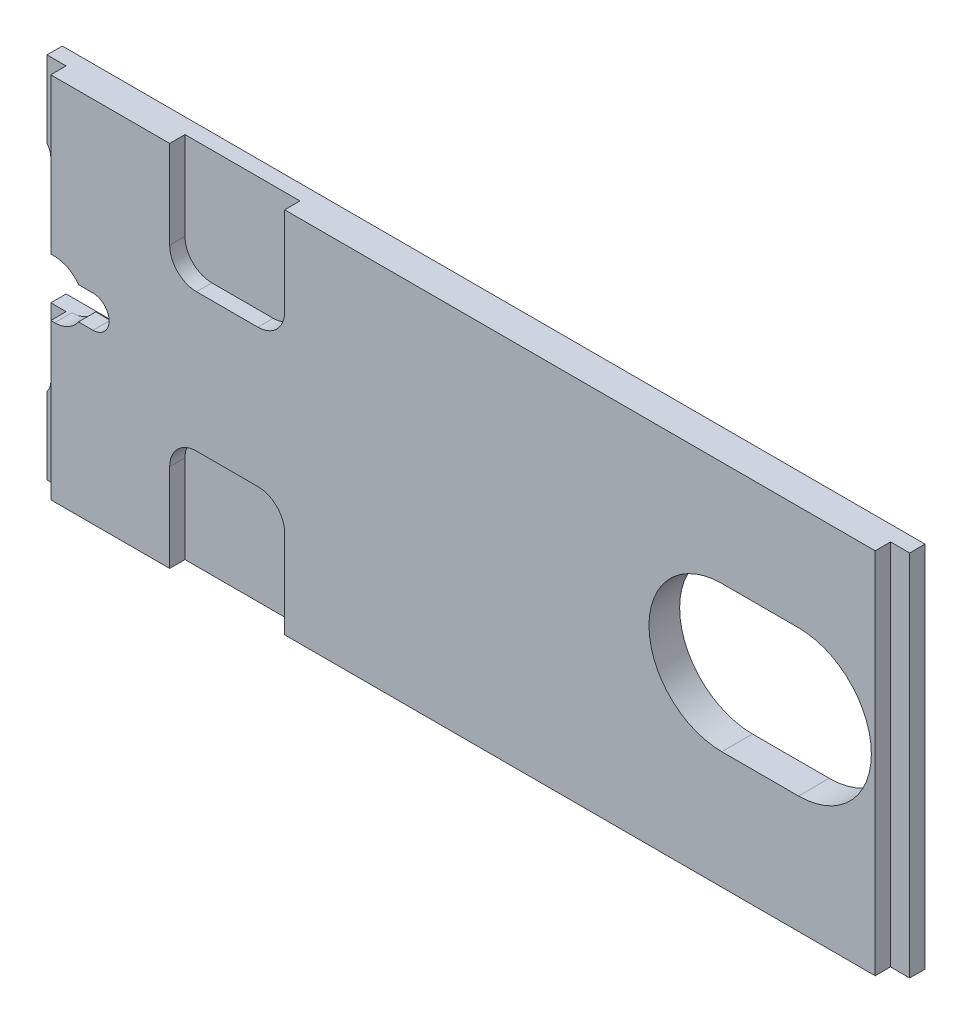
ISO-10303-21;
HEADER;
FILE_DESCRIPTION(('STEP AP214'),'2;1');
FILE_NAME('part.step','',(''),(''),'','','');
FILE_SCHEMA(('AUTOMOTIVE_DESIGN { 1 0 10303 214 1 1 1 1 }'));
ENDSEC;
DATA;
#1=APPLICATION_CONTEXT('core data for automotive mechanical design processes');
#2=APPLICATION_PROTOCOL_DEFINITION('international standard','automotive_design',2000,#1);
#3=PRODUCT_CONTEXT('',#1,'mechanical');
#4=PRODUCT('Part','Part','',(#3));
#5=PRODUCT_RELATED_PRODUCT_CATEGORY('part','',(#4));
#6=PRODUCT_DEFINITION_FORMATION('','',#4);
#7=PRODUCT_DEFINITION_CONTEXT('part definition',#1,'design');
#8=PRODUCT_DEFINITION('design','',#6,#7);
#9=PRODUCT_DEFINITION_SHAPE('','',#8);
#10=(LENGTH_UNIT() NAMED_UNIT(*) SI_UNIT(.MILLI.,.METRE.));
#11=(NAMED_UNIT(*) PLANE_ANGLE_UNIT() SI_UNIT($,.RADIAN.));
#12=(NAMED_UNIT(*) SI_UNIT($,.STERADIAN.) SOLID_ANGLE_UNIT());
#13=UNCERTAINTY_MEASURE_WITH_UNIT(LENGTH_MEASURE(1.E-05),#10,'distance_accuracy_value','');
#14=(GEOMETRIC_REPRESENTATION_CONTEXT(3) GLOBAL_UNCERTAINTY_ASSIGNED_CONTEXT((#13)) GLOBAL_UNIT_ASSIGNED_CONTEXT((#10,
#11,#12)) REPRESENTATION_CONTEXT('',''));
#15=CARTESIAN_POINT('',(0.,0.,0.));
#16=DIRECTION('',(0.,0.,1.));
#17=DIRECTION('',(1.,0.,0.));
#18=AXIS2_PLACEMENT_3D('',#15,#16,#17);
#19=CARTESIAN_POINT('',(-19.,25.354248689,0.));
#20=DIRECTION('',(0.,0.,1.));
#21=DIRECTION('',(1.,0.,0.));
#22=AXIS2_PLACEMENT_3D('',#19,#20,#21);
#23=CYLINDRICAL_SURFACE('',#22,4.);
#24=DIRECTION('',(0.,0.,1.));
#25=VECTOR('',#24,1.);
#26=CARTESIAN_POINT('',(-15.,25.354248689,2.));
#27=LINE('',#26,#25);
#28=CARTESIAN_POINT('',(-14.999999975,25.354248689,0.));
#29=VERTEX_POINT('',#28);
#30=CARTESIAN_POINT('',(-15.,25.354248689,4.));
#31=VERTEX_POINT('',#30);
#32=EDGE_CURVE('E621',#29,#31,#27,.T.);
#33=ORIENTED_EDGE('',*,*,#32,.T.);
#34=CARTESIAN_POINT('',(-19.,25.354248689,4.));
#35=DIRECTION('',(0.,0.,1.));
#36=DIRECTION('',(1.,0.,0.));
#37=AXIS2_PLACEMENT_3D('',#34,#35,#36);
#38=CIRCLE('',#37,4.);
#39=CARTESIAN_POINT('',(-16.,28.0000000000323,4.));
#40=VERTEX_POINT('',#39);
#41=EDGE_CURVE('E339',#31,#40,#38,.T.);
#42=ORIENTED_EDGE('',*,*,#41,.T.);
#43=DIRECTION('',(0.,0.,-1.));
#44=VECTOR('',#43,1.);
#45=CARTESIAN_POINT('',(-16.,28.,2.));
#46=LINE('',#45,#44);
#47=CARTESIAN_POINT('',(-16.,28.0000000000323,0.));
#48=VERTEX_POINT('',#47);
#49=EDGE_CURVE('E326',#40,#48,#46,.T.);
#50=ORIENTED_EDGE('',*,*,#49,.T.);
#51=CARTESIAN_POINT('',(-19.,25.354248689,0.));
#52=DIRECTION('',(0.,0.,1.));
#53=DIRECTION('',(1.,0.,0.));
#54=AXIS2_PLACEMENT_3D('',#51,#52,#53);
#55=CIRCLE('',#54,4.);
#56=EDGE_CURVE('E338',#29,#48,#55,.T.);
#57=ORIENTED_EDGE('',*,*,#56,.F.);
#58=EDGE_LOOP('',(#33,#42,#50,#57));
#59=FACE_BOUND('',#58,.T.);
#60=ADVANCED_FACE('F14',(#59),#23,.F.);
#61=CARTESIAN_POINT('',(-19.,-25.354248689,0.));
#62=DIRECTION('',(0.,0.,1.));
#63=DIRECTION('',(1.,0.,0.));
#64=AXIS2_PLACEMENT_3D('',#61,#62,#63);
#65=CYLINDRICAL_SURFACE('',#64,4.);
#66=DIRECTION('',(0.,0.,1.));
#67=VECTOR('',#66,1.);
#68=CARTESIAN_POINT('',(-16.,-28.,2.));
#69=LINE('',#68,#67);
#70=CARTESIAN_POINT('',(-16.,-28.0000000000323,0.));
#71=VERTEX_POINT('',#70);
#72=CARTESIAN_POINT('',(-16.,-28.0000000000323,4.));
#73=VERTEX_POINT('',#72);
#74=EDGE_CURVE('E333',#71,#73,#69,.T.);
#75=ORIENTED_EDGE('',*,*,#74,.T.);
#76=CARTESIAN_POINT('',(-19.,-25.354248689,4.));
#77=DIRECTION('',(0.,0.,1.));
#78=DIRECTION('',(1.,0.,0.));
#79=AXIS2_PLACEMENT_3D('',#76,#77,#78);
#80=CIRCLE('',#79,4.);
#81=CARTESIAN_POINT('',(-15.,-25.354248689,4.));
#82=VERTEX_POINT('',#81);
#83=EDGE_CURVE('E327',#73,#82,#80,.T.);
#84=ORIENTED_EDGE('',*,*,#83,.T.);
#85=DIRECTION('',(0.,0.,-1.));
#86=VECTOR('',#85,1.);
#87=CARTESIAN_POINT('',(-15.,-25.354248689,2.));
#88=LINE('',#87,#86);
#89=CARTESIAN_POINT('',(-14.999999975,-25.354248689,0.));
#90=VERTEX_POINT('',#89);
#91=EDGE_CURVE('E322',#82,#90,#88,.T.);
#92=ORIENTED_EDGE('',*,*,#91,.T.);
#93=CARTESIAN_POINT('',(-19.,-25.354248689,0.));
#94=DIRECTION('',(0.,0.,1.));
#95=DIRECTION('',(1.,0.,0.));
#96=AXIS2_PLACEMENT_3D('',#93,#94,#95);
#97=CIRCLE('',#96,4.);
#98=EDGE_CURVE('E356',#71,#90,#97,.T.);
#99=ORIENTED_EDGE('',*,*,#98,.F.);
#100=EDGE_LOOP('',(#75,#84,#92,#99));
#101=FACE_BOUND('',#100,.T.);
#102=ADVANCED_FACE('F741',(#101),#65,.F.);
#103=CARTESIAN_POINT('',(-15.,-7.5,4.));
#104=DIRECTION('',(1.,0.,0.));
#105=DIRECTION('',(0.,-1.,0.));
#106=AXIS2_PLACEMENT_3D('',#103,#104,#105);
#107=PLANE('',#106);
#108=ORIENTED_EDGE('',*,*,#91,.F.);
#109=DIRECTION('',(0.,1.,0.));
#110=VECTOR('',#109,1.);
#111=CARTESIAN_POINT('',(-15.,-27.75,4.));
#112=LINE('',#111,#110);
#113=CARTESIAN_POINT('',(-15.,-7.5,4.));
#114=VERTEX_POINT('',#113);
#115=EDGE_CURVE('E324',#82,#114,#112,.T.);
#116=ORIENTED_EDGE('',*,*,#115,.T.);
#117=DIRECTION('',(0.,0.,-1.));
#118=VECTOR('',#117,1.);
#119=CARTESIAN_POINT('',(-15.,-7.5,4.));
#120=LINE('',#119,#118);
#121=CARTESIAN_POINT('',(-14.9999999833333,-7.5,0.));
#122=VERTEX_POINT('',#121);
#123=EDGE_CURVE('E657',#114,#122,#120,.T.);
#124=ORIENTED_EDGE('',*,*,#123,.T.);
#125=DIRECTION('',(0.,1.,0.));
#126=VECTOR('',#125,1.);
#127=CARTESIAN_POINT('',(-14.99999995,0.,0.));
#128=LINE('',#127,#126);
#129=EDGE_CURVE('E351',#90,#122,#128,.T.);
#130=ORIENTED_EDGE('',*,*,#129,.F.);
#131=EDGE_LOOP('',(#108,#116,#124,#130));
#132=FACE_BOUND('',#131,.T.);
#133=ADVANCED_FACE('F744',(#132),#107,.F.);
#134=CARTESIAN_POINT('',(-15.,25.354248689,4.));
#135=DIRECTION('',(1.,0.,0.));
#136=DIRECTION('',(0.,-1.,0.));
#137=AXIS2_PLACEMENT_3D('',#134,#135,#136);
#138=PLANE('',#137);
#139=ORIENTED_EDGE('',*,*,#32,.F.);
#140=DIRECTION('',(0.,1.,0.));
#141=VECTOR('',#140,1.);
#142=CARTESIAN_POINT('',(-14.99999995,0.,0.));
#143=LINE('',#142,#141);
#144=CARTESIAN_POINT('',(-14.9999999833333,7.5,0.));
#145=VERTEX_POINT('',#144);
#146=EDGE_CURVE('E347',#145,#29,#143,.T.);
#147=ORIENTED_EDGE('',*,*,#146,.F.);
#148=DIRECTION('',(0.,0.,1.));
#149=VECTOR('',#148,1.);
#150=CARTESIAN_POINT('',(-15.,7.5,4.));
#151=LINE('',#150,#149);
#152=CARTESIAN_POINT('',(-15.,7.5,4.));
#153=VERTEX_POINT('',#152);
#154=EDGE_CURVE('E667',#145,#153,#151,.T.);
#155=ORIENTED_EDGE('',*,*,#154,.T.);
#156=DIRECTION('',(0.,1.,0.));
#157=VECTOR('',#156,1.);
#158=CARTESIAN_POINT('',(-15.,27.75,4.));
#159=LINE('',#158,#157);
#160=EDGE_CURVE('E342',#153,#31,#159,.T.);
#161=ORIENTED_EDGE('',*,*,#160,.T.);
#162=EDGE_LOOP('',(#139,#147,#155,#161));
#163=FACE_BOUND('',#162,.T.);
#164=ADVANCED_FACE('F638',(#163),#138,.F.);
#165=CARTESIAN_POINT('',(-16.,-48.,4.));
#166=DIRECTION('',(1.,0.,0.));
#167=DIRECTION('',(0.,0.,-1.));
#168=AXIS2_PLACEMENT_3D('',#165,#166,#167);
#169=PLANE('',#168);
#170=ORIENTED_EDGE('',*,*,#74,.F.);
#171=DIRECTION('',(0.,1.,0.));
#172=VECTOR('',#171,1.);
#173=CARTESIAN_POINT('',(-16.,0.,0.));
#174=LINE('',#173,#172);
#175=CARTESIAN_POINT('',(-16.,-48.,0.));
#176=VERTEX_POINT('',#175);
#177=EDGE_CURVE('E359',#176,#71,#174,.T.);
#178=ORIENTED_EDGE('',*,*,#177,.F.);
#179=DIRECTION('',(0.,0.,1.));
#180=VECTOR('',#179,1.);
#181=CARTESIAN_POINT('',(-16.,-48.,4.));
#182=LINE('',#181,#180);
#183=CARTESIAN_POINT('',(-16.,-48.,4.));
#184=VERTEX_POINT('',#183);
#185=EDGE_CURVE('E571',#176,#184,#182,.T.);
#186=ORIENTED_EDGE('',*,*,#185,.T.);
#187=DIRECTION('',(0.,1.,0.));
#188=VECTOR('',#187,1.);
#189=CARTESIAN_POINT('',(-16.,-27.75,4.));
#190=LINE('',#189,#188);
#191=EDGE_CURVE('E330',#184,#73,#190,.T.);
#192=ORIENTED_EDGE('',*,*,#191,.T.);
#193=EDGE_LOOP('',(#170,#178,#186,#192));
#194=FACE_BOUND('',#193,.T.);
#195=ADVANCED_FACE('F728',(#194),#169,.F.);
#196=CARTESIAN_POINT('',(20.,-48.,4.));
#197=DIRECTION('',(0.,0.,-1.));
#198=DIRECTION('',(0.,1.,0.));
#199=AXIS2_PLACEMENT_3D('',#196,#197,#198);
#200=PLANE('',#199);
#201=DIRECTION('',(0.,1.,0.));
#202=VECTOR('',#201,1.);
#203=CARTESIAN_POINT('',(50.,-36.5,4.));
#204=LINE('',#203,#202);
#205=CARTESIAN_POINT('',(49.9999999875,-48.,4.));
#206=VERTEX_POINT('',#205);
#207=CARTESIAN_POINT('',(50.,-24.9999999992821,4.));
#208=VERTEX_POINT('',#207);
#209=EDGE_CURVE('E607',#206,#208,#204,.T.);
#210=ORIENTED_EDGE('',*,*,#209,.T.);
#211=CARTESIAN_POINT('',(43.,-25.,4.));
#212=DIRECTION('',(0.,0.,1.));
#213=DIRECTION('',(1.,0.,0.));
#214=AXIS2_PLACEMENT_3D('',#211,#212,#213);
#215=CIRCLE('',#214,7.);
#216=CARTESIAN_POINT('',(43.,-18.,4.));
#217=VERTEX_POINT('',#216);
#218=EDGE_CURVE('E498',#217,#208,#215,.F.);
#219=ORIENTED_EDGE('',*,*,#218,.F.);
#220=DIRECTION('',(-1.,0.,0.));
#221=VECTOR('',#220,1.);
#222=CARTESIAN_POINT('',(35.,-18.,4.));
#223=LINE('',#222,#221);
#224=CARTESIAN_POINT('',(26.9999999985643,-18.,4.));
#225=VERTEX_POINT('',#224);
#226=EDGE_CURVE('E495',#217,#225,#223,.T.);
#227=ORIENTED_EDGE('',*,*,#226,.T.);
#228=CARTESIAN_POINT('',(27.,-25.,4.));
#229=DIRECTION('',(0.,0.,1.));
#230=DIRECTION('',(1.,0.,0.));
#231=AXIS2_PLACEMENT_3D('',#228,#229,#230);
#232=CIRCLE('',#231,7.);
#233=CARTESIAN_POINT('',(20.,-25.,4.));
#234=VERTEX_POINT('',#233);
#235=EDGE_CURVE('E491',#234,#225,#232,.F.);
#236=ORIENTED_EDGE('',*,*,#235,.F.);
#237=DIRECTION('',(0.,-1.,0.));
#238=VECTOR('',#237,1.);
#239=CARTESIAN_POINT('',(20.,-36.5,4.));
#240=LINE('',#239,#238);
#241=CARTESIAN_POINT('',(20.000000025,-48.,4.));
#242=VERTEX_POINT('',#241);
#243=EDGE_CURVE('E476',#234,#242,#240,.T.);
#244=ORIENTED_EDGE('',*,*,#243,.T.);
#245=DIRECTION('',(1.,0.,0.));
#246=VECTOR('',#245,1.);
#247=CARTESIAN_POINT('',(71.5,-48.,4.));
#248=LINE('',#247,#246);
#249=EDGE_CURVE('E481',#242,#206,#248,.T.);
#250=ORIENTED_EDGE('',*,*,#249,.T.);
#251=EDGE_LOOP('',(#210,#219,#227,#236,#244,#250));
#252=FACE_BOUND('',#251,.T.);
#253=ADVANCED_FACE('F1028',(#252),#200,.F.);
#254=CARTESIAN_POINT('',(-16.,-48.,4.));
#255=DIRECTION('',(0.,0.,-1.));
#256=DIRECTION('',(0.,1.,0.));
#257=AXIS2_PLACEMENT_3D('',#254,#255,#256);
#258=PLANE('',#257);
#259=ORIENTED_EDGE('',*,*,#115,.F.);
#260=ORIENTED_EDGE('',*,*,#83,.F.);
#261=ORIENTED_EDGE('',*,*,#191,.F.);
#262=DIRECTION('',(1.,0.,0.));
#263=VECTOR('',#262,1.);
#264=CARTESIAN_POINT('',(71.5,-48.,4.));
#265=LINE('',#264,#263);
#266=CARTESIAN_POINT('',(-10.9999999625,-48.,4.));
#267=VERTEX_POINT('',#266);
#268=EDGE_CURVE('E482',#184,#267,#265,.T.);
#269=ORIENTED_EDGE('',*,*,#268,.T.);
#270=DIRECTION('',(0.,1.,0.));
#271=VECTOR('',#270,1.);
#272=CARTESIAN_POINT('',(-11.,-27.75,4.));
#273=LINE('',#272,#271);
#274=CARTESIAN_POINT('',(-10.9999999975,-7.5,4.));
#275=VERTEX_POINT('',#274);
#276=EDGE_CURVE('E372',#267,#275,#273,.T.);
#277=ORIENTED_EDGE('',*,*,#276,.T.);
#278=DIRECTION('',(-1.,0.,0.));
#279=VECTOR('',#278,1.);
#280=CARTESIAN_POINT('',(-7.5,-7.5,4.));
#281=LINE('',#280,#279);
#282=EDGE_CURVE('E537',#275,#114,#281,.T.);
#283=ORIENTED_EDGE('',*,*,#282,.T.);
#284=EDGE_LOOP('',(#259,#260,#261,#269,#277,#283));
#285=FACE_BOUND('',#284,.T.);
#286=ADVANCED_FACE('F736',(#285),#258,.F.);
#287=CARTESIAN_POINT('',(-16.,28.,4.));
#288=DIRECTION('',(1.,0.,0.));
#289=DIRECTION('',(0.,0.,-1.));
#290=AXIS2_PLACEMENT_3D('',#287,#288,#289);
#291=PLANE('',#290);
#292=ORIENTED_EDGE('',*,*,#49,.F.);
#293=DIRECTION('',(0.,1.,0.));
#294=VECTOR('',#293,1.);
#295=CARTESIAN_POINT('',(-16.,27.75,4.));
#296=LINE('',#295,#294);
#297=CARTESIAN_POINT('',(-16.,48.,4.));
#298=VERTEX_POINT('',#297);
#299=EDGE_CURVE('E336',#40,#298,#296,.T.);
#300=ORIENTED_EDGE('',*,*,#299,.T.);
#301=DIRECTION('',(0.,0.,1.));
#302=VECTOR('',#301,1.);
#303=CARTESIAN_POINT('',(-16.,48.,4.));
#304=LINE('',#303,#302);
#305=CARTESIAN_POINT('',(-16.,48.,0.));
#306=VERTEX_POINT('',#305);
#307=EDGE_CURVE('E555',#306,#298,#304,.T.);
#308=ORIENTED_EDGE('',*,*,#307,.F.);
#309=DIRECTION('',(0.,1.,0.));
#310=VECTOR('',#309,1.);
#311=CARTESIAN_POINT('',(-16.,0.,0.));
#312=LINE('',#311,#310);
#313=EDGE_CURVE('E362',#48,#306,#312,.T.);
#314=ORIENTED_EDGE('',*,*,#313,.F.);
#315=EDGE_LOOP('',(#292,#300,#308,#314));
#316=FACE_BOUND('',#315,.T.);
#317=ADVANCED_FACE('F626',(#316),#291,.F.);
#318=CARTESIAN_POINT('',(-16.,7.5,4.));
#319=DIRECTION('',(0.,0.,-1.));
#320=DIRECTION('',(0.,1.,0.));
#321=AXIS2_PLACEMENT_3D('',#318,#319,#320);
#322=PLANE('',#321);
#323=ORIENTED_EDGE('',*,*,#41,.F.);
#324=ORIENTED_EDGE('',*,*,#160,.F.);
#325=DIRECTION('',(1.,0.,0.));
#326=VECTOR('',#325,1.);
#327=CARTESIAN_POINT('',(-7.5,7.5,4.));
#328=LINE('',#327,#326);
#329=CARTESIAN_POINT('',(-10.9999999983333,7.5,4.));
#330=VERTEX_POINT('',#329);
#331=EDGE_CURVE('E545',#153,#330,#328,.T.);
#332=ORIENTED_EDGE('',*,*,#331,.T.);
#333=DIRECTION('',(0.,1.,0.));
#334=VECTOR('',#333,1.);
#335=CARTESIAN_POINT('',(-11.,27.75,4.));
#336=LINE('',#335,#334);
#337=CARTESIAN_POINT('',(-10.99999995,48.,4.));
#338=VERTEX_POINT('',#337);
#339=EDGE_CURVE('E465',#330,#338,#336,.T.);
#340=ORIENTED_EDGE('',*,*,#339,.T.);
#341=DIRECTION('',(1.,0.,0.));
#342=VECTOR('',#341,1.);
#343=CARTESIAN_POINT('',(71.5,48.,4.));
#344=LINE('',#343,#342);
#345=EDGE_CURVE('E455',#298,#338,#344,.T.);
#346=ORIENTED_EDGE('',*,*,#345,.F.);
#347=ORIENTED_EDGE('',*,*,#299,.F.);
#348=EDGE_LOOP('',(#323,#324,#332,#340,#346,#347));
#349=FACE_BOUND('',#348,.T.);
#350=ADVANCED_FACE('F629',(#349),#322,.F.);
#351=CARTESIAN_POINT('',(20.,48.,4.));
#352=DIRECTION('',(0.,0.,1.));
#353=DIRECTION('',(0.,-1.,0.));
#354=AXIS2_PLACEMENT_3D('',#351,#352,#353);
#355=PLANE('',#354);
#356=DIRECTION('',(1.,0.,0.));
#357=VECTOR('',#356,1.);
#358=CARTESIAN_POINT('',(71.5,48.,4.));
#359=LINE('',#358,#357);
#360=CARTESIAN_POINT('',(20.0000000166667,48.,4.));
#361=VERTEX_POINT('',#360);
#362=CARTESIAN_POINT('',(49.9999999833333,48.,4.));
#363=VERTEX_POINT('',#362);
#364=EDGE_CURVE('E513',#361,#363,#359,.T.);
#365=ORIENTED_EDGE('',*,*,#364,.F.);
#366=DIRECTION('',(0.,-1.,0.));
#367=VECTOR('',#366,1.);
#368=CARTESIAN_POINT('',(20.,36.5,4.));
#369=LINE('',#368,#367);
#370=CARTESIAN_POINT('',(20.,25.0000000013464,4.));
#371=VERTEX_POINT('',#370);
#372=EDGE_CURVE('E442',#361,#371,#369,.T.);
#373=ORIENTED_EDGE('',*,*,#372,.T.);
#374=CARTESIAN_POINT('',(27.,25.,4.));
#375=DIRECTION('',(0.,0.,1.));
#376=DIRECTION('',(1.,0.,0.));
#377=AXIS2_PLACEMENT_3D('',#374,#375,#376);
#378=CIRCLE('',#377,7.);
#379=CARTESIAN_POINT('',(26.9999999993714,18.,4.));
#380=VERTEX_POINT('',#379);
#381=EDGE_CURVE('E438',#380,#371,#378,.F.);
#382=ORIENTED_EDGE('',*,*,#381,.F.);
#383=DIRECTION('',(1.,0.,0.));
#384=VECTOR('',#383,1.);
#385=CARTESIAN_POINT('',(35.,18.,4.));
#386=LINE('',#385,#384);
#387=CARTESIAN_POINT('',(43.,18.,4.));
#388=VERTEX_POINT('',#387);
#389=EDGE_CURVE('E543',#380,#388,#386,.T.);
#390=ORIENTED_EDGE('',*,*,#389,.T.);
#391=CARTESIAN_POINT('',(43.,25.,4.));
#392=DIRECTION('',(0.,0.,1.));
#393=DIRECTION('',(1.,0.,0.));
#394=AXIS2_PLACEMENT_3D('',#391,#392,#393);
#395=CIRCLE('',#394,7.);
#396=CARTESIAN_POINT('',(50.,25.,4.));
#397=VERTEX_POINT('',#396);
#398=EDGE_CURVE('E523',#397,#388,#395,.F.);
#399=ORIENTED_EDGE('',*,*,#398,.F.);
#400=DIRECTION('',(0.,1.,0.));
#401=VECTOR('',#400,1.);
#402=CARTESIAN_POINT('',(50.,36.5,4.));
#403=LINE('',#402,#401);
#404=EDGE_CURVE('E519',#397,#363,#403,.T.);
#405=ORIENTED_EDGE('',*,*,#404,.T.);
#406=EDGE_LOOP('',(#365,#373,#382,#390,#399,#405));
#407=FACE_BOUND('',#406,.T.);
#408=ADVANCED_FACE('F710',(#407),#355,.T.);
#409=CARTESIAN_POINT('',(-16.,-48.,0.));
#410=DIRECTION('',(0.,0.,-1.));
#411=DIRECTION('',(0.,1.,0.));
#412=AXIS2_PLACEMENT_3D('',#409,#410,#411);
#413=PLANE('',#412);
#414=CARTESIAN_POINT('',(184.,1.60748590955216,0.));
#415=DIRECTION('',(0.,0.,-1.));
#416=DIRECTION('',(-1.,0.,0.));
#417=AXIS2_PLACEMENT_3D('',#414,#415,#416);
#418=CIRCLE('',#417,19.);
#419=CARTESIAN_POINT('',(184.,20.6074859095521,0.));
#420=VERTEX_POINT('',#419);
#421=CARTESIAN_POINT('',(184.,-17.3925140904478,0.));
#422=VERTEX_POINT('',#421);
#423=EDGE_CURVE('E38',#420,#422,#418,.T.);
#424=ORIENTED_EDGE('',*,*,#423,.F.);
#425=DIRECTION('',(1.,0.,0.));
#426=VECTOR('',#425,1.);
#427=CARTESIAN_POINT('',(184.,20.6074859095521,0.));
#428=LINE('',#427,#426);
#429=CARTESIAN_POINT('',(164.,20.6074859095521,0.));
#430=VERTEX_POINT('',#429);
#431=EDGE_CURVE('E305',#430,#420,#428,.T.);
#432=ORIENTED_EDGE('',*,*,#431,.F.);
#433=CARTESIAN_POINT('',(164.,1.60748590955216,0.));
#434=DIRECTION('',(0.,0.,-1.));
#435=DIRECTION('',(-1.,0.,0.));
#436=AXIS2_PLACEMENT_3D('',#433,#434,#435);
#437=CIRCLE('',#436,19.);
#438=CARTESIAN_POINT('',(164.,-17.3925140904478,0.));
#439=VERTEX_POINT('',#438);
#440=EDGE_CURVE('E302',#439,#430,#437,.T.);
#441=ORIENTED_EDGE('',*,*,#440,.F.);
#442=DIRECTION('',(-1.,0.,0.));
#443=VECTOR('',#442,1.);
#444=CARTESIAN_POINT('',(164.,-17.3925140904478,0.));
#445=LINE('',#444,#443);
#446=EDGE_CURVE('E299',#422,#439,#445,.T.);
#447=ORIENTED_EDGE('',*,*,#446,.F.);
#448=EDGE_LOOP('',(#424,#432,#441,#447));
#449=FACE_BOUND('',#448,.T.);
#450=ORIENTED_EDGE('',*,*,#313,.T.);
#451=DIRECTION('',(-1.,0.,0.));
#452=VECTOR('',#451,1.);
#453=CARTESIAN_POINT('',(71.5,48.,0.));
#454=LINE('',#453,#452);
#455=CARTESIAN_POINT('',(209.,48.,0.));
#456=VERTEX_POINT('',#455);
#457=EDGE_CURVE('E512',#456,#306,#454,.T.);
#458=ORIENTED_EDGE('',*,*,#457,.F.);
#459=DIRECTION('',(0.,-1.,0.));
#460=VECTOR('',#459,1.);
#461=CARTESIAN_POINT('',(209.,48.,0.));
#462=LINE('',#461,#460);
#463=CARTESIAN_POINT('',(209.,-48.,0.));
#464=VERTEX_POINT('',#463);
#465=EDGE_CURVE('E311',#456,#464,#462,.T.);
#466=ORIENTED_EDGE('',*,*,#465,.T.);
#467=DIRECTION('',(-1.,0.,0.));
#468=VECTOR('',#467,1.);
#469=CARTESIAN_POINT('',(71.5,-48.,0.));
#470=LINE('',#469,#468);
#471=EDGE_CURVE('E504',#464,#176,#470,.T.);
#472=ORIENTED_EDGE('',*,*,#471,.T.);
#473=ORIENTED_EDGE('',*,*,#177,.T.);
#474=ORIENTED_EDGE('',*,*,#98,.T.);
#475=ORIENTED_EDGE('',*,*,#129,.T.);
#476=DIRECTION('',(1.,0.,0.));
#477=VECTOR('',#476,1.);
#478=CARTESIAN_POINT('',(-7.5,-7.5,0.));
#479=LINE('',#478,#477);
#480=CARTESIAN_POINT('',(-1.53825216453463E-09,-7.5,0.));
#481=VERTEX_POINT('',#480);
#482=EDGE_CURVE('E612',#122,#481,#479,.T.);
#483=ORIENTED_EDGE('',*,*,#482,.T.);
#484=CARTESIAN_POINT('',(0.,0.,0.));
#485=DIRECTION('',(0.,0.,-1.));
#486=DIRECTION('',(-1.,0.,0.));
#487=AXIS2_PLACEMENT_3D('',#484,#485,#486);
#488=CIRCLE('',#487,7.5);
#489=CARTESIAN_POINT('',(0.,7.5,0.));
#490=VERTEX_POINT('',#489);
#491=EDGE_CURVE('E535',#490,#481,#488,.T.);
#492=ORIENTED_EDGE('',*,*,#491,.F.);
#493=DIRECTION('',(-1.,0.,0.));
#494=VECTOR('',#493,1.);
#495=CARTESIAN_POINT('',(-7.5,7.5,0.));
#496=LINE('',#495,#494);
#497=EDGE_CURVE('E532',#490,#145,#496,.T.);
#498=ORIENTED_EDGE('',*,*,#497,.T.);
#499=ORIENTED_EDGE('',*,*,#146,.T.);
#500=ORIENTED_EDGE('',*,*,#56,.T.);
#501=EDGE_LOOP('',(#450,#458,#466,#472,#473,#474,#475,#483,#492,#498,#499,#500));
#502=FACE_BOUND('',#501,.T.);
#503=ADVANCED_FACE('F635',(#449,#502),#413,.T.);
#504=CARTESIAN_POINT('',(-15.,-7.5,8.));
#505=DIRECTION('',(0.,-1.,0.));
#506=DIRECTION('',(0.,0.,-1.));
#507=AXIS2_PLACEMENT_3D('',#504,#505,#506);
#508=PLANE('',#507);
#509=ORIENTED_EDGE('',*,*,#123,.F.);
#510=ORIENTED_EDGE('',*,*,#282,.F.);
#511=DIRECTION('',(0.,0.,1.));
#512=VECTOR('',#511,1.);
#513=CARTESIAN_POINT('',(-11.,-7.5,6.));
#514=LINE('',#513,#512);
#515=CARTESIAN_POINT('',(-10.9999999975,-7.5,8.));
#516=VERTEX_POINT('',#515);
#517=EDGE_CURVE('E373',#275,#516,#514,.T.);
#518=ORIENTED_EDGE('',*,*,#517,.T.);
#519=DIRECTION('',(-1.,0.,0.));
#520=VECTOR('',#519,1.);
#521=CARTESIAN_POINT('',(-7.5,-7.5,8.));
#522=LINE('',#521,#520);
#523=CARTESIAN_POINT('',(-10.0000000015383,-7.5,8.));
#524=VERTEX_POINT('',#523);
#525=EDGE_CURVE('E350',#524,#516,#522,.T.);
#526=ORIENTED_EDGE('',*,*,#525,.F.);
#527=DIRECTION('',(0.,0.,-1.));
#528=VECTOR('',#527,1.);
#529=CARTESIAN_POINT('',(-10.0000000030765,-7.5,5.75));
#530=LINE('',#529,#528);
#531=CARTESIAN_POINT('',(-10.0000000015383,-7.5,3.5));
#532=VERTEX_POINT('',#531);
#533=EDGE_CURVE('E381',#532,#524,#530,.F.);
#534=ORIENTED_EDGE('',*,*,#533,.F.);
#535=DIRECTION('',(1.,0.,0.));
#536=VECTOR('',#535,1.);
#537=CARTESIAN_POINT('',(-1.25,-7.5,3.5));
#538=LINE('',#537,#536);
#539=CARTESIAN_POINT('',(-1.53825216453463E-09,-7.5,3.5));
#540=VERTEX_POINT('',#539);
#541=EDGE_CURVE('E379',#532,#540,#538,.T.);
#542=ORIENTED_EDGE('',*,*,#541,.T.);
#543=DIRECTION('',(0.,0.,-1.));
#544=VECTOR('',#543,1.);
#545=CARTESIAN_POINT('',(-3.07654943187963E-09,-7.5,1.75));
#546=LINE('',#545,#544);
#547=EDGE_CURVE('E527',#481,#540,#546,.F.);
#548=ORIENTED_EDGE('',*,*,#547,.F.);
#549=ORIENTED_EDGE('',*,*,#482,.F.);
#550=EDGE_LOOP('',(#509,#510,#518,#526,#534,#542,#548,#549));
#551=FACE_BOUND('',#550,.T.);
#552=ADVANCED_FACE('F749',(#551),#508,.F.);
#553=CARTESIAN_POINT('',(0.,0.,3.5));
#554=DIRECTION('',(0.,0.,-1.));
#555=DIRECTION('',(-1.,0.,0.));
#556=AXIS2_PLACEMENT_3D('',#553,#554,#555);
#557=CYLINDRICAL_SURFACE('',#556,7.5);
#558=ORIENTED_EDGE('',*,*,#547,.T.);
#559=CARTESIAN_POINT('',(0.,0.,3.5));
#560=DIRECTION('',(0.,0.,-1.));
#561=DIRECTION('',(-1.,0.,0.));
#562=AXIS2_PLACEMENT_3D('',#559,#560,#561);
#563=CIRCLE('',#562,7.5);
#564=CARTESIAN_POINT('',(0.,7.5,3.5));
#565=VERTEX_POINT('',#564);
#566=EDGE_CURVE('E378',#540,#565,#563,.F.);
#567=ORIENTED_EDGE('',*,*,#566,.T.);
#568=DIRECTION('',(0.,0.,-1.));
#569=VECTOR('',#568,1.);
#570=CARTESIAN_POINT('',(0.,7.5,4.));
#571=LINE('',#570,#569);
#572=EDGE_CURVE('E526',#565,#490,#571,.T.);
#573=ORIENTED_EDGE('',*,*,#572,.T.);
#574=ORIENTED_EDGE('',*,*,#491,.T.);
#575=EDGE_LOOP('',(#558,#567,#573,#574));
#576=FACE_BOUND('',#575,.T.);
#577=ADVANCED_FACE('F753',(#576),#557,.F.);
#578=CARTESIAN_POINT('',(-15.,7.5,0.));
#579=DIRECTION('',(0.,1.,0.));
#580=DIRECTION('',(0.,0.,1.));
#581=AXIS2_PLACEMENT_3D('',#578,#579,#580);
#582=PLANE('',#581);
#583=ORIENTED_EDGE('',*,*,#154,.F.);
#584=ORIENTED_EDGE('',*,*,#497,.F.);
#585=ORIENTED_EDGE('',*,*,#572,.F.);
#586=DIRECTION('',(-1.,0.,0.));
#587=VECTOR('',#586,1.);
#588=CARTESIAN_POINT('',(-1.25,7.5,3.5));
#589=LINE('',#588,#587);
#590=CARTESIAN_POINT('',(-10.,7.5,3.5));
#591=VERTEX_POINT('',#590);
#592=EDGE_CURVE('E374',#565,#591,#589,.T.);
#593=ORIENTED_EDGE('',*,*,#592,.T.);
#594=DIRECTION('',(0.,0.,1.));
#595=VECTOR('',#594,1.);
#596=CARTESIAN_POINT('',(-10.,7.5,5.75));
#597=LINE('',#596,#595);
#598=CARTESIAN_POINT('',(-10.,7.5,8.));
#599=VERTEX_POINT('',#598);
#600=EDGE_CURVE('E468',#599,#591,#597,.F.);
#601=ORIENTED_EDGE('',*,*,#600,.F.);
#602=DIRECTION('',(1.,0.,0.));
#603=VECTOR('',#602,1.);
#604=CARTESIAN_POINT('',(-7.5,7.5,8.));
#605=LINE('',#604,#603);
#606=CARTESIAN_POINT('',(-10.9999999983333,7.5,8.));
#607=VERTEX_POINT('',#606);
#608=EDGE_CURVE('E524',#607,#599,#605,.T.);
#609=ORIENTED_EDGE('',*,*,#608,.F.);
#610=DIRECTION('',(0.,0.,-1.));
#611=VECTOR('',#610,1.);
#612=CARTESIAN_POINT('',(-11.,7.5,6.));
#613=LINE('',#612,#611);
#614=EDGE_CURVE('E462',#607,#330,#613,.T.);
#615=ORIENTED_EDGE('',*,*,#614,.T.);
#616=ORIENTED_EDGE('',*,*,#331,.F.);
#617=EDGE_LOOP('',(#583,#584,#585,#593,#601,#609,#615,#616));
#618=FACE_BOUND('',#617,.T.);
#619=ADVANCED_FACE('F689',(#618),#582,.F.);
#620=CARTESIAN_POINT('',(27.,18.,8.));
#621=DIRECTION('',(0.,-1.,0.));
#622=DIRECTION('',(0.,0.,-1.));
#623=AXIS2_PLACEMENT_3D('',#620,#621,#622);
#624=PLANE('',#623);
#625=DIRECTION('',(0.,0.,-1.));
#626=VECTOR('',#625,1.);
#627=CARTESIAN_POINT('',(43.,18.,6.));
#628=LINE('',#627,#626);
#629=CARTESIAN_POINT('',(43.,18.,8.));
#630=VERTEX_POINT('',#629);
#631=EDGE_CURVE('E520',#388,#630,#628,.F.);
#632=ORIENTED_EDGE('',*,*,#631,.F.);
#633=ORIENTED_EDGE('',*,*,#389,.F.);
#634=DIRECTION('',(0.,0.,1.));
#635=VECTOR('',#634,1.);
#636=CARTESIAN_POINT('',(26.9999999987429,18.,6.));
#637=LINE('',#636,#635);
#638=CARTESIAN_POINT('',(26.9999999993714,18.,8.));
#639=VERTEX_POINT('',#638);
#640=EDGE_CURVE('E439',#639,#380,#637,.F.);
#641=ORIENTED_EDGE('',*,*,#640,.F.);
#642=DIRECTION('',(1.,0.,0.));
#643=VECTOR('',#642,1.);
#644=CARTESIAN_POINT('',(71.5,18.,8.));
#645=LINE('',#644,#643);
#646=EDGE_CURVE('E406',#639,#630,#645,.T.);
#647=ORIENTED_EDGE('',*,*,#646,.T.);
#648=EDGE_LOOP('',(#632,#633,#641,#647));
#649=FACE_BOUND('',#648,.T.);
#650=ADVANCED_FACE('F961',(#649),#624,.F.);
#651=CARTESIAN_POINT('',(43.,25.,4.));
#652=DIRECTION('',(0.,0.,1.));
#653=DIRECTION('',(1.,0.,0.));
#654=AXIS2_PLACEMENT_3D('',#651,#652,#653);
#655=CYLINDRICAL_SURFACE('',#654,7.);
#656=ORIENTED_EDGE('',*,*,#398,.T.);
#657=ORIENTED_EDGE('',*,*,#631,.T.);
#658=CARTESIAN_POINT('',(43.,25.,8.));
#659=DIRECTION('',(0.,0.,1.));
#660=DIRECTION('',(1.,0.,0.));
#661=AXIS2_PLACEMENT_3D('',#658,#659,#660);
#662=CIRCLE('',#661,7.);
#663=CARTESIAN_POINT('',(50.000000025,25.,8.));
#664=VERTEX_POINT('',#663);
#665=EDGE_CURVE('E403',#630,#664,#662,.T.);
#666=ORIENTED_EDGE('',*,*,#665,.T.);
#667=DIRECTION('',(0.,0.,-1.));
#668=VECTOR('',#667,1.);
#669=CARTESIAN_POINT('',(50.,25.,6.));
#670=LINE('',#669,#668);
#671=EDGE_CURVE('E516',#664,#397,#670,.T.);
#672=ORIENTED_EDGE('',*,*,#671,.T.);
#673=EDGE_LOOP('',(#656,#657,#666,#672));
#674=FACE_BOUND('',#673,.T.);
#675=ADVANCED_FACE('F953',(#674),#655,.F.);
#676=CARTESIAN_POINT('',(50.,48.,8.));
#677=DIRECTION('',(1.,0.,0.));
#678=DIRECTION('',(0.,-1.,0.));
#679=AXIS2_PLACEMENT_3D('',#676,#677,#678);
#680=PLANE('',#679);
#681=DIRECTION('',(0.,0.,1.));
#682=VECTOR('',#681,1.);
#683=CARTESIAN_POINT('',(49.999999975,48.,4.));
#684=LINE('',#683,#682);
#685=CARTESIAN_POINT('',(50.000000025,48.,8.));
#686=VERTEX_POINT('',#685);
#687=EDGE_CURVE('E510',#363,#686,#684,.T.);
#688=ORIENTED_EDGE('',*,*,#687,.F.);
#689=ORIENTED_EDGE('',*,*,#404,.F.);
#690=ORIENTED_EDGE('',*,*,#671,.F.);
#691=DIRECTION('',(0.,1.,0.));
#692=VECTOR('',#691,1.);
#693=CARTESIAN_POINT('',(50.00000005,0.,8.));
#694=LINE('',#693,#692);
#695=EDGE_CURVE('E401',#664,#686,#694,.T.);
#696=ORIENTED_EDGE('',*,*,#695,.T.);
#697=EDGE_LOOP('',(#688,#689,#690,#696));
#698=FACE_BOUND('',#697,.T.);
#699=ADVANCED_FACE('F944',(#698),#680,.F.);
#700=CARTESIAN_POINT('',(50.,-25.,8.));
#701=DIRECTION('',(1.,0.,0.));
#702=DIRECTION('',(0.,-1.,0.));
#703=AXIS2_PLACEMENT_3D('',#700,#701,#702);
#704=PLANE('',#703);
#705=DIRECTION('',(0.,0.,-1.));
#706=VECTOR('',#705,1.);
#707=CARTESIAN_POINT('',(50.,-24.9999999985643,6.));
#708=LINE('',#707,#706);
#709=CARTESIAN_POINT('',(50.000000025,-24.9999999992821,8.));
#710=VERTEX_POINT('',#709);
#711=EDGE_CURVE('E496',#208,#710,#708,.F.);
#712=ORIENTED_EDGE('',*,*,#711,.F.);
#713=ORIENTED_EDGE('',*,*,#209,.F.);
#714=DIRECTION('',(0.,0.,1.));
#715=VECTOR('',#714,1.);
#716=CARTESIAN_POINT('',(49.999999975,-48.,4.));
#717=LINE('',#716,#715);
#718=CARTESIAN_POINT('',(50.000000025,-48.,8.));
#719=VERTEX_POINT('',#718);
#720=EDGE_CURVE('E501',#206,#719,#717,.T.);
#721=ORIENTED_EDGE('',*,*,#720,.T.);
#722=DIRECTION('',(0.,1.,0.));
#723=VECTOR('',#722,1.);
#724=CARTESIAN_POINT('',(50.00000005,0.,8.));
#725=LINE('',#724,#723);
#726=EDGE_CURVE('E397',#719,#710,#725,.T.);
#727=ORIENTED_EDGE('',*,*,#726,.T.);
#728=EDGE_LOOP('',(#712,#713,#721,#727));
#729=FACE_BOUND('',#728,.T.);
#730=ADVANCED_FACE('F935',(#729),#704,.F.);
#731=CARTESIAN_POINT('',(43.,-25.,4.));
#732=DIRECTION('',(0.,0.,1.));
#733=DIRECTION('',(1.,0.,0.));
#734=AXIS2_PLACEMENT_3D('',#731,#732,#733);
#735=CYLINDRICAL_SURFACE('',#734,7.);
#736=ORIENTED_EDGE('',*,*,#218,.T.);
#737=ORIENTED_EDGE('',*,*,#711,.T.);
#738=CARTESIAN_POINT('',(43.,-25.,8.));
#739=DIRECTION('',(0.,0.,1.));
#740=DIRECTION('',(1.,0.,0.));
#741=AXIS2_PLACEMENT_3D('',#738,#739,#740);
#742=CIRCLE('',#741,7.);
#743=CARTESIAN_POINT('',(43.,-18.,8.));
#744=VERTEX_POINT('',#743);
#745=EDGE_CURVE('E396',#710,#744,#742,.T.);
#746=ORIENTED_EDGE('',*,*,#745,.T.);
#747=DIRECTION('',(0.,0.,-1.));
#748=VECTOR('',#747,1.);
#749=CARTESIAN_POINT('',(43.,-18.,6.));
#750=LINE('',#749,#748);
#751=EDGE_CURVE('E492',#744,#217,#750,.T.);
#752=ORIENTED_EDGE('',*,*,#751,.T.);
#753=EDGE_LOOP('',(#736,#737,#746,#752));
#754=FACE_BOUND('',#753,.T.);
#755=ADVANCED_FACE('F926',(#754),#735,.F.);
#756=CARTESIAN_POINT('',(27.,-18.,4.));
#757=DIRECTION('',(0.,1.,0.));
#758=DIRECTION('',(0.,0.,1.));
#759=AXIS2_PLACEMENT_3D('',#756,#757,#758);
#760=PLANE('',#759);
#761=DIRECTION('',(0.,0.,-1.));
#762=VECTOR('',#761,1.);
#763=CARTESIAN_POINT('',(26.9999999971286,-18.,6.));
#764=LINE('',#763,#762);
#765=CARTESIAN_POINT('',(26.9999999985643,-18.,8.));
#766=VERTEX_POINT('',#765);
#767=EDGE_CURVE('E477',#225,#766,#764,.F.);
#768=ORIENTED_EDGE('',*,*,#767,.F.);
#769=ORIENTED_EDGE('',*,*,#226,.F.);
#770=ORIENTED_EDGE('',*,*,#751,.F.);
#771=DIRECTION('',(-1.,0.,0.));
#772=VECTOR('',#771,1.);
#773=CARTESIAN_POINT('',(71.5,-18.,8.));
#774=LINE('',#773,#772);
#775=EDGE_CURVE('E394',#744,#766,#774,.T.);
#776=ORIENTED_EDGE('',*,*,#775,.T.);
#777=EDGE_LOOP('',(#768,#769,#770,#776));
#778=FACE_BOUND('',#777,.T.);
#779=ADVANCED_FACE('F917',(#778),#760,.F.);
#780=CARTESIAN_POINT('',(27.,-25.,4.));
#781=DIRECTION('',(0.,0.,1.));
#782=DIRECTION('',(1.,0.,0.));
#783=AXIS2_PLACEMENT_3D('',#780,#781,#782);
#784=CYLINDRICAL_SURFACE('',#783,7.);
#785=ORIENTED_EDGE('',*,*,#235,.T.);
#786=ORIENTED_EDGE('',*,*,#767,.T.);
#787=CARTESIAN_POINT('',(27.,-25.,8.));
#788=DIRECTION('',(0.,0.,1.));
#789=DIRECTION('',(1.,0.,0.));
#790=AXIS2_PLACEMENT_3D('',#787,#788,#789);
#791=CIRCLE('',#790,7.);
#792=CARTESIAN_POINT('',(20.00000001,-25.,8.));
#793=VERTEX_POINT('',#792);
#794=EDGE_CURVE('E391',#766,#793,#791,.T.);
#795=ORIENTED_EDGE('',*,*,#794,.T.);
#796=DIRECTION('',(0.,0.,-1.));
#797=VECTOR('',#796,1.);
#798=CARTESIAN_POINT('',(20.,-25.,6.));
#799=LINE('',#798,#797);
#800=EDGE_CURVE('E473',#793,#234,#799,.T.);
#801=ORIENTED_EDGE('',*,*,#800,.T.);
#802=EDGE_LOOP('',(#785,#786,#795,#801));
#803=FACE_BOUND('',#802,.T.);
#804=ADVANCED_FACE('F909',(#803),#784,.F.);
#805=CARTESIAN_POINT('',(20.,-48.,4.));
#806=DIRECTION('',(-1.,0.,0.));
#807=DIRECTION('',(0.,0.,1.));
#808=AXIS2_PLACEMENT_3D('',#805,#806,#807);
#809=PLANE('',#808);
#810=DIRECTION('',(0.,0.,-1.));
#811=VECTOR('',#810,1.);
#812=CARTESIAN_POINT('',(20.00000005,-48.,4.));
#813=LINE('',#812,#811);
#814=CARTESIAN_POINT('',(20.00000003,-48.,8.));
#815=VERTEX_POINT('',#814);
#816=EDGE_CURVE('E478',#815,#242,#813,.T.);
#817=ORIENTED_EDGE('',*,*,#816,.T.);
#818=ORIENTED_EDGE('',*,*,#243,.F.);
#819=ORIENTED_EDGE('',*,*,#800,.F.);
#820=DIRECTION('',(0.,-1.,0.));
#821=VECTOR('',#820,1.);
#822=CARTESIAN_POINT('',(20.00000002,0.,8.));
#823=LINE('',#822,#821);
#824=EDGE_CURVE('E388',#793,#815,#823,.T.);
#825=ORIENTED_EDGE('',*,*,#824,.T.);
#826=EDGE_LOOP('',(#817,#818,#819,#825));
#827=FACE_BOUND('',#826,.T.);
#828=ADVANCED_FACE('F789',(#827),#809,.F.);
#829=CARTESIAN_POINT('',(-16.,-48.,0.));
#830=DIRECTION('',(0.,1.,0.));
#831=DIRECTION('',(0.,0.,1.));
#832=AXIS2_PLACEMENT_3D('',#829,#830,#831);
#833=PLANE('',#832);
#834=DIRECTION('',(0.,0.,-1.));
#835=VECTOR('',#834,1.);
#836=CARTESIAN_POINT('',(209.,-48.,8.));
#837=LINE('',#836,#835);
#838=CARTESIAN_POINT('',(209.,-48.,4.));
#839=VERTEX_POINT('',#838);
#840=EDGE_CURVE('E320',#839,#464,#837,.T.);
#841=ORIENTED_EDGE('',*,*,#840,.F.);
#842=DIRECTION('',(-1.,0.,0.));
#843=VECTOR('',#842,1.);
#844=CARTESIAN_POINT('',(-16.,-48.,4.));
#845=LINE('',#844,#843);
#846=CARTESIAN_POINT('',(204.,-48.,4.));
#847=VERTEX_POINT('',#846);
#848=EDGE_CURVE('E30',#839,#847,#845,.T.);
#849=ORIENTED_EDGE('',*,*,#848,.T.);
#850=DIRECTION('',(0.,0.,1.));
#851=VECTOR('',#850,1.);
#852=CARTESIAN_POINT('',(204.,-48.,0.));
#853=LINE('',#852,#851);
#854=CARTESIAN_POINT('',(204.,-48.,8.));
#855=VERTEX_POINT('',#854);
#856=EDGE_CURVE('E279',#847,#855,#853,.T.);
#857=ORIENTED_EDGE('',*,*,#856,.T.);
#858=DIRECTION('',(-1.,0.,0.));
#859=VECTOR('',#858,1.);
#860=CARTESIAN_POINT('',(71.5,-48.,8.));
#861=LINE('',#860,#859);
#862=EDGE_CURVE('E18',#855,#719,#861,.T.);
#863=ORIENTED_EDGE('',*,*,#862,.T.);
#864=ORIENTED_EDGE('',*,*,#720,.F.);
#865=ORIENTED_EDGE('',*,*,#249,.F.);
#866=ORIENTED_EDGE('',*,*,#816,.F.);
#867=DIRECTION('',(-1.,0.,0.));
#868=VECTOR('',#867,1.);
#869=CARTESIAN_POINT('',(71.5,-48.,8.));
#870=LINE('',#869,#868);
#871=CARTESIAN_POINT('',(-10.9999999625,-48.,8.));
#872=VERTEX_POINT('',#871);
#873=EDGE_CURVE('E390',#815,#872,#870,.T.);
#874=ORIENTED_EDGE('',*,*,#873,.T.);
#875=DIRECTION('',(0.,0.,-1.));
#876=VECTOR('',#875,1.);
#877=CARTESIAN_POINT('',(-11.,-48.,6.));
#878=LINE('',#877,#876);
#879=EDGE_CURVE('E369',#872,#267,#878,.T.);
#880=ORIENTED_EDGE('',*,*,#879,.T.);
#881=ORIENTED_EDGE('',*,*,#268,.F.);
#882=ORIENTED_EDGE('',*,*,#185,.F.);
#883=ORIENTED_EDGE('',*,*,#471,.F.);
#884=EDGE_LOOP('',(#841,#849,#857,#863,#864,#865,#866,#874,#880,#881,#882,#883));
#885=FACE_BOUND('',#884,.T.);
#886=ADVANCED_FACE('F720',(#885),#833,.F.);
#887=CARTESIAN_POINT('',(-11.,-48.,8.));
#888=DIRECTION('',(1.,0.,0.));
#889=DIRECTION('',(0.,0.,-1.));
#890=AXIS2_PLACEMENT_3D('',#887,#888,#889);
#891=PLANE('',#890);
#892=ORIENTED_EDGE('',*,*,#879,.F.);
#893=DIRECTION('',(0.,1.,0.));
#894=VECTOR('',#893,1.);
#895=CARTESIAN_POINT('',(-11.,0.,8.));
#896=LINE('',#895,#894);
#897=EDGE_CURVE('E486',#872,#516,#896,.T.);
#898=ORIENTED_EDGE('',*,*,#897,.T.);
#899=ORIENTED_EDGE('',*,*,#517,.F.);
#900=ORIENTED_EDGE('',*,*,#276,.F.);
#901=EDGE_LOOP('',(#892,#898,#899,#900));
#902=FACE_BOUND('',#901,.T.);
#903=ADVANCED_FACE('F779',(#902),#891,.F.);
#904=CARTESIAN_POINT('',(-11.,7.5,8.));
#905=DIRECTION('',(1.,0.,0.));
#906=DIRECTION('',(0.,0.,-1.));
#907=AXIS2_PLACEMENT_3D('',#904,#905,#906);
#908=PLANE('',#907);
#909=DIRECTION('',(0.,0.,1.));
#910=VECTOR('',#909,1.);
#911=CARTESIAN_POINT('',(-10.999999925,48.,4.));
#912=LINE('',#911,#910);
#913=CARTESIAN_POINT('',(-10.999999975,48.,8.));
#914=VERTEX_POINT('',#913);
#915=EDGE_CURVE('E446',#338,#914,#912,.T.);
#916=ORIENTED_EDGE('',*,*,#915,.F.);
#917=ORIENTED_EDGE('',*,*,#339,.F.);
#918=ORIENTED_EDGE('',*,*,#614,.F.);
#919=DIRECTION('',(0.,1.,0.));
#920=VECTOR('',#919,1.);
#921=CARTESIAN_POINT('',(-11.,0.,8.));
#922=LINE('',#921,#920);
#923=EDGE_CURVE('E450',#607,#914,#922,.T.);
#924=ORIENTED_EDGE('',*,*,#923,.T.);
#925=EDGE_LOOP('',(#916,#917,#918,#924));
#926=FACE_BOUND('',#925,.T.);
#927=ADVANCED_FACE('F693',(#926),#908,.F.);
#928=CARTESIAN_POINT('',(-16.,48.,0.));
#929=DIRECTION('',(0.,1.,0.));
#930=DIRECTION('',(0.,0.,1.));
#931=AXIS2_PLACEMENT_3D('',#928,#929,#930);
#932=PLANE('',#931);
#933=DIRECTION('',(-1.,0.,0.));
#934=VECTOR('',#933,1.);
#935=CARTESIAN_POINT('',(209.,48.,4.));
#936=LINE('',#935,#934);
#937=CARTESIAN_POINT('',(209.,48.,4.));
#938=VERTEX_POINT('',#937);
#939=CARTESIAN_POINT('',(204.,48.,4.));
#940=VERTEX_POINT('',#939);
#941=EDGE_CURVE('E283',#938,#940,#936,.T.);
#942=ORIENTED_EDGE('',*,*,#941,.F.);
#943=DIRECTION('',(0.,0.,-1.));
#944=VECTOR('',#943,1.);
#945=CARTESIAN_POINT('',(209.,48.,8.));
#946=LINE('',#945,#944);
#947=EDGE_CURVE('E319',#938,#456,#946,.T.);
#948=ORIENTED_EDGE('',*,*,#947,.T.);
#949=ORIENTED_EDGE('',*,*,#457,.T.);
#950=ORIENTED_EDGE('',*,*,#307,.T.);
#951=ORIENTED_EDGE('',*,*,#345,.T.);
#952=ORIENTED_EDGE('',*,*,#915,.T.);
#953=DIRECTION('',(1.,0.,0.));
#954=VECTOR('',#953,1.);
#955=CARTESIAN_POINT('',(71.5,48.,8.));
#956=LINE('',#955,#954);
#957=CARTESIAN_POINT('',(20.0000000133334,48.,8.));
#958=VERTEX_POINT('',#957);
#959=EDGE_CURVE('E385',#914,#958,#956,.T.);
#960=ORIENTED_EDGE('',*,*,#959,.T.);
#961=DIRECTION('',(0.,0.,-1.));
#962=VECTOR('',#961,1.);
#963=CARTESIAN_POINT('',(20.,48.,6.));
#964=LINE('',#963,#962);
#965=EDGE_CURVE('E443',#958,#361,#964,.T.);
#966=ORIENTED_EDGE('',*,*,#965,.T.);
#967=ORIENTED_EDGE('',*,*,#364,.T.);
#968=ORIENTED_EDGE('',*,*,#687,.T.);
#969=DIRECTION('',(1.,0.,0.));
#970=VECTOR('',#969,1.);
#971=CARTESIAN_POINT('',(71.5,48.,8.));
#972=LINE('',#971,#970);
#973=CARTESIAN_POINT('',(204.,48.,8.));
#974=VERTEX_POINT('',#973);
#975=EDGE_CURVE('E292',#686,#974,#972,.T.);
#976=ORIENTED_EDGE('',*,*,#975,.T.);
#977=DIRECTION('',(0.,0.,1.));
#978=VECTOR('',#977,1.);
#979=CARTESIAN_POINT('',(204.,48.,4.));
#980=LINE('',#979,#978);
#981=EDGE_CURVE('E276',#940,#974,#980,.T.);
#982=ORIENTED_EDGE('',*,*,#981,.F.);
#983=EDGE_LOOP('',(#942,#948,#949,#950,#951,#952,#960,#966,#967,#968,#976,#982));
#984=FACE_BOUND('',#983,.T.);
#985=ADVANCED_FACE('F289',(#984),#932,.T.);
#986=CARTESIAN_POINT('',(20.,25.,4.));
#987=DIRECTION('',(-1.,0.,0.));
#988=DIRECTION('',(0.,0.,1.));
#989=AXIS2_PLACEMENT_3D('',#986,#987,#988);
#990=PLANE('',#989);
#991=DIRECTION('',(0.,0.,-1.));
#992=VECTOR('',#991,1.);
#993=CARTESIAN_POINT('',(20.,25.0000000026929,6.));
#994=LINE('',#993,#992);
#995=CARTESIAN_POINT('',(20.00000001,25.0000000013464,8.));
#996=VERTEX_POINT('',#995);
#997=EDGE_CURVE('E435',#371,#996,#994,.F.);
#998=ORIENTED_EDGE('',*,*,#997,.F.);
#999=ORIENTED_EDGE('',*,*,#372,.F.);
#1000=ORIENTED_EDGE('',*,*,#965,.F.);
#1001=DIRECTION('',(0.,-1.,0.));
#1002=VECTOR('',#1001,1.);
#1003=CARTESIAN_POINT('',(20.00000002,0.,8.));
#1004=LINE('',#1003,#1002);
#1005=EDGE_CURVE('E382',#958,#996,#1004,.T.);
#1006=ORIENTED_EDGE('',*,*,#1005,.T.);
#1007=EDGE_LOOP('',(#998,#999,#1000,#1006));
#1008=FACE_BOUND('',#1007,.T.);
#1009=ADVANCED_FACE('F704',(#1008),#990,.F.);
#1010=CARTESIAN_POINT('',(27.,25.,4.));
#1011=DIRECTION('',(0.,0.,1.));
#1012=DIRECTION('',(1.,0.,0.));
#1013=AXIS2_PLACEMENT_3D('',#1010,#1011,#1012);
#1014=CYLINDRICAL_SURFACE('',#1013,7.);
#1015=ORIENTED_EDGE('',*,*,#381,.T.);
#1016=ORIENTED_EDGE('',*,*,#997,.T.);
#1017=CARTESIAN_POINT('',(27.,25.,8.));
#1018=DIRECTION('',(0.,0.,1.));
#1019=DIRECTION('',(1.,0.,0.));
#1020=AXIS2_PLACEMENT_3D('',#1017,#1018,#1019);
#1021=CIRCLE('',#1020,7.);
#1022=EDGE_CURVE('E384',#996,#639,#1021,.T.);
#1023=ORIENTED_EDGE('',*,*,#1022,.T.);
#1024=ORIENTED_EDGE('',*,*,#640,.T.);
#1025=EDGE_LOOP('',(#1015,#1016,#1023,#1024));
#1026=FACE_BOUND('',#1025,.T.);
#1027=ADVANCED_FACE('F707',(#1026),#1014,.F.);
#1028=CARTESIAN_POINT('',(-10.,0.,8.));
#1029=DIRECTION('',(0.,0.,-1.));
#1030=DIRECTION('',(-1.,0.,0.));
#1031=AXIS2_PLACEMENT_3D('',#1028,#1029,#1030);
#1032=CYLINDRICAL_SURFACE('',#1031,7.5);
#1033=DIRECTION('',(0.,0.,-1.));
#1034=VECTOR('',#1033,1.);
#1035=CARTESIAN_POINT('',(-3.786305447,-4.2,5.75));
#1036=LINE('',#1035,#1034);
#1037=CARTESIAN_POINT('',(-3.7863054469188,-4.2,8.));
#1038=VERTEX_POINT('',#1037);
#1039=CARTESIAN_POINT('',(-3.7863054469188,-4.2,3.5));
#1040=VERTEX_POINT('',#1039);
#1041=EDGE_CURVE('E423',#1038,#1040,#1036,.T.);
#1042=ORIENTED_EDGE('',*,*,#1041,.T.);
#1043=CARTESIAN_POINT('',(-10.,0.,3.5));
#1044=DIRECTION('',(0.,0.,-1.));
#1045=DIRECTION('',(-1.,0.,0.));
#1046=AXIS2_PLACEMENT_3D('',#1043,#1044,#1045);
#1047=CIRCLE('',#1046,7.5);
#1048=EDGE_CURVE('E377',#1040,#532,#1047,.T.);
#1049=ORIENTED_EDGE('',*,*,#1048,.T.);
#1050=ORIENTED_EDGE('',*,*,#533,.T.);
#1051=CARTESIAN_POINT('',(-10.,0.,8.));
#1052=DIRECTION('',(0.,0.,-1.));
#1053=DIRECTION('',(-1.,0.,0.));
#1054=AXIS2_PLACEMENT_3D('',#1051,#1052,#1053);
#1055=CIRCLE('',#1054,7.5);
#1056=EDGE_CURVE('E591',#524,#1038,#1055,.F.);
#1057=ORIENTED_EDGE('',*,*,#1056,.T.);
#1058=EDGE_LOOP('',(#1042,#1049,#1050,#1057));
#1059=FACE_BOUND('',#1058,.T.);
#1060=ADVANCED_FACE('F775',(#1059),#1032,.F.);
#1061=CARTESIAN_POINT('',(-10.105,7.5,3.5));
#1062=DIRECTION('',(0.,0.,1.));
#1063=DIRECTION('',(0.,-1.,0.));
#1064=AXIS2_PLACEMENT_3D('',#1061,#1062,#1063);
#1065=PLANE('',#1064);
#1066=ORIENTED_EDGE('',*,*,#1048,.F.);
#1067=DIRECTION('',(-1.,0.,0.));
#1068=VECTOR('',#1067,1.);
#1069=CARTESIAN_POINT('',(-1.15,-4.19999999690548,3.5));
#1070=LINE('',#1069,#1068);
#1071=CARTESIAN_POINT('',(0.,-4.2,3.5));
#1072=VERTEX_POINT('',#1071);
#1073=EDGE_CURVE('E413',#1072,#1040,#1070,.T.);
#1074=ORIENTED_EDGE('',*,*,#1073,.F.);
#1075=CARTESIAN_POINT('',(0.,0.,3.5));
#1076=DIRECTION('',(0.,0.,-1.));
#1077=DIRECTION('',(-1.,0.,0.));
#1078=AXIS2_PLACEMENT_3D('',#1075,#1076,#1077);
#1079=CIRCLE('',#1078,4.2);
#1080=CARTESIAN_POINT('',(0.,4.19999999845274,3.5));
#1081=VERTEX_POINT('',#1080);
#1082=EDGE_CURVE('E416',#1081,#1072,#1079,.T.);
#1083=ORIENTED_EDGE('',*,*,#1082,.F.);
#1084=DIRECTION('',(1.,0.,0.));
#1085=VECTOR('',#1084,1.);
#1086=CARTESIAN_POINT('',(-1.15,4.19999999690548,3.5));
#1087=LINE('',#1086,#1085);
#1088=CARTESIAN_POINT('',(-3.7863054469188,4.2,3.5));
#1089=VERTEX_POINT('',#1088);
#1090=EDGE_CURVE('E409',#1089,#1081,#1087,.T.);
#1091=ORIENTED_EDGE('',*,*,#1090,.F.);
#1092=CARTESIAN_POINT('',(-10.,0.,3.5));
#1093=DIRECTION('',(0.,0.,-1.));
#1094=DIRECTION('',(-1.,0.,0.));
#1095=AXIS2_PLACEMENT_3D('',#1092,#1093,#1094);
#1096=CIRCLE('',#1095,7.5);
#1097=EDGE_CURVE('E408',#591,#1089,#1096,.T.);
#1098=ORIENTED_EDGE('',*,*,#1097,.F.);
#1099=ORIENTED_EDGE('',*,*,#592,.F.);
#1100=ORIENTED_EDGE('',*,*,#566,.F.);
#1101=ORIENTED_EDGE('',*,*,#541,.F.);
#1102=EDGE_LOOP('',(#1066,#1074,#1083,#1091,#1098,#1099,#1100,#1101));
#1103=FACE_BOUND('',#1102,.T.);
#1104=ADVANCED_FACE('F758',(#1103),#1065,.F.);
#1105=CARTESIAN_POINT('',(-10.,0.,8.));
#1106=DIRECTION('',(0.,0.,-1.));
#1107=DIRECTION('',(-1.,0.,0.));
#1108=AXIS2_PLACEMENT_3D('',#1105,#1106,#1107);
#1109=CYLINDRICAL_SURFACE('',#1108,7.5);
#1110=ORIENTED_EDGE('',*,*,#600,.T.);
#1111=ORIENTED_EDGE('',*,*,#1097,.T.);
#1112=DIRECTION('',(0.,0.,1.));
#1113=VECTOR('',#1112,1.);
#1114=CARTESIAN_POINT('',(-3.786305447,4.2,5.75));
#1115=LINE('',#1114,#1113);
#1116=CARTESIAN_POINT('',(-3.7863054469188,4.2,8.));
#1117=VERTEX_POINT('',#1116);
#1118=EDGE_CURVE('E417',#1089,#1117,#1115,.T.);
#1119=ORIENTED_EDGE('',*,*,#1118,.T.);
#1120=CARTESIAN_POINT('',(-10.,0.,8.));
#1121=DIRECTION('',(0.,0.,-1.));
#1122=DIRECTION('',(-1.,0.,0.));
#1123=AXIS2_PLACEMENT_3D('',#1120,#1121,#1122);
#1124=CIRCLE('',#1123,7.5);
#1125=EDGE_CURVE('E459',#1117,#599,#1124,.F.);
#1126=ORIENTED_EDGE('',*,*,#1125,.T.);
#1127=EDGE_LOOP('',(#1110,#1111,#1119,#1126));
#1128=FACE_BOUND('',#1127,.T.);
#1129=ADVANCED_FACE('F761',(#1128),#1109,.F.);
#1130=CARTESIAN_POINT('',(-11.,-48.,8.));
#1131=DIRECTION('',(0.,0.,-1.));
#1132=DIRECTION('',(0.,1.,0.));
#1133=AXIS2_PLACEMENT_3D('',#1130,#1131,#1132);
#1134=PLANE('',#1133);
#1135=DIRECTION('',(1.,0.,0.));
#1136=VECTOR('',#1135,1.);
#1137=CARTESIAN_POINT('',(-11.,20.6074859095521,8.));
#1138=LINE('',#1137,#1136);
#1139=CARTESIAN_POINT('',(164.,20.6074859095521,8.));
#1140=VERTEX_POINT('',#1139);
#1141=CARTESIAN_POINT('',(184.,20.6074859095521,8.));
#1142=VERTEX_POINT('',#1141);
#1143=EDGE_CURVE('E1137',#1140,#1142,#1138,.T.);
#1144=ORIENTED_EDGE('',*,*,#1143,.T.);
#1145=CARTESIAN_POINT('',(184.,1.60748590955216,8.));
#1146=DIRECTION('',(0.,0.,-1.));
#1147=DIRECTION('',(-1.,0.,0.));
#1148=AXIS2_PLACEMENT_3D('',#1145,#1146,#1147);
#1149=CIRCLE('',#1148,19.);
#1150=CARTESIAN_POINT('',(184.,-17.3925140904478,8.));
#1151=VERTEX_POINT('',#1150);
#1152=EDGE_CURVE('E24',#1142,#1151,#1149,.T.);
#1153=ORIENTED_EDGE('',*,*,#1152,.T.);
#1154=DIRECTION('',(-1.,0.,0.));
#1155=VECTOR('',#1154,1.);
#1156=CARTESIAN_POINT('',(-11.,-17.3925140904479,8.));
#1157=LINE('',#1156,#1155);
#1158=CARTESIAN_POINT('',(164.,-17.3925140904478,8.));
#1159=VERTEX_POINT('',#1158);
#1160=EDGE_CURVE('E412',#1151,#1159,#1157,.T.);
#1161=ORIENTED_EDGE('',*,*,#1160,.T.);
#1162=CARTESIAN_POINT('',(164.,1.60748590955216,8.));
#1163=DIRECTION('',(0.,0.,-1.));
#1164=DIRECTION('',(-1.,0.,0.));
#1165=AXIS2_PLACEMENT_3D('',#1162,#1163,#1164);
#1166=CIRCLE('',#1165,19.);
#1167=EDGE_CURVE('E1139',#1159,#1140,#1166,.T.);
#1168=ORIENTED_EDGE('',*,*,#1167,.T.);
#1169=EDGE_LOOP('',(#1144,#1153,#1161,#1168));
#1170=FACE_BOUND('',#1169,.T.);
#1171=ORIENTED_EDGE('',*,*,#862,.F.);
#1172=DIRECTION('',(0.,1.,0.));
#1173=VECTOR('',#1172,1.);
#1174=CARTESIAN_POINT('',(204.,-48.0001033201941,8.));
#1175=LINE('',#1174,#1173);
#1176=EDGE_CURVE('E280',#855,#974,#1175,.T.);
#1177=ORIENTED_EDGE('',*,*,#1176,.T.);
#1178=ORIENTED_EDGE('',*,*,#975,.F.);
#1179=ORIENTED_EDGE('',*,*,#695,.F.);
#1180=ORIENTED_EDGE('',*,*,#665,.F.);
#1181=ORIENTED_EDGE('',*,*,#646,.F.);
#1182=ORIENTED_EDGE('',*,*,#1022,.F.);
#1183=ORIENTED_EDGE('',*,*,#1005,.F.);
#1184=ORIENTED_EDGE('',*,*,#959,.F.);
#1185=ORIENTED_EDGE('',*,*,#923,.F.);
#1186=ORIENTED_EDGE('',*,*,#608,.T.);
#1187=ORIENTED_EDGE('',*,*,#1125,.F.);
#1188=DIRECTION('',(1.,0.,0.));
#1189=VECTOR('',#1188,1.);
#1190=CARTESIAN_POINT('',(-1.8931527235,4.2,8.));
#1191=LINE('',#1190,#1189);
#1192=CARTESIAN_POINT('',(0.,4.2,8.));
#1193=VERTEX_POINT('',#1192);
#1194=EDGE_CURVE('E419',#1117,#1193,#1191,.T.);
#1195=ORIENTED_EDGE('',*,*,#1194,.T.);
#1196=CARTESIAN_POINT('',(0.,0.,8.));
#1197=DIRECTION('',(0.,0.,-1.));
#1198=DIRECTION('',(-1.,0.,0.));
#1199=AXIS2_PLACEMENT_3D('',#1196,#1197,#1198);
#1200=CIRCLE('',#1199,4.2);
#1201=CARTESIAN_POINT('',(0.,-4.2,8.));
#1202=VERTEX_POINT('',#1201);
#1203=EDGE_CURVE('E428',#1202,#1193,#1200,.F.);
#1204=ORIENTED_EDGE('',*,*,#1203,.F.);
#1205=DIRECTION('',(-1.,0.,0.));
#1206=VECTOR('',#1205,1.);
#1207=CARTESIAN_POINT('',(-1.8931527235,-4.2,8.));
#1208=LINE('',#1207,#1206);
#1209=EDGE_CURVE('E427',#1202,#1038,#1208,.T.);
#1210=ORIENTED_EDGE('',*,*,#1209,.T.);
#1211=ORIENTED_EDGE('',*,*,#1056,.F.);
#1212=ORIENTED_EDGE('',*,*,#525,.T.);
#1213=ORIENTED_EDGE('',*,*,#897,.F.);
#1214=ORIENTED_EDGE('',*,*,#873,.F.);
#1215=ORIENTED_EDGE('',*,*,#824,.F.);
#1216=ORIENTED_EDGE('',*,*,#794,.F.);
#1217=ORIENTED_EDGE('',*,*,#775,.F.);
#1218=ORIENTED_EDGE('',*,*,#745,.F.);
#1219=ORIENTED_EDGE('',*,*,#726,.F.);
#1220=EDGE_LOOP('',(#1171,#1177,#1178,#1179,#1180,#1181,#1182,#1183,#1184,#1185,#1186,#1187,
#1195,#1204,#1210,#1211,#1212,#1213,#1214,#1215,#1216,#1217,#1218,#1219));
#1221=FACE_BOUND('',#1220,.T.);
#1222=ADVANCED_FACE('F699',(#1170,#1221),#1134,.F.);
#1223=CARTESIAN_POINT('',(0.,0.,8.));
#1224=DIRECTION('',(0.,0.,-1.));
#1225=DIRECTION('',(-1.,0.,0.));
#1226=AXIS2_PLACEMENT_3D('',#1223,#1224,#1225);
#1227=CYLINDRICAL_SURFACE('',#1226,4.2);
#1228=DIRECTION('',(0.,0.,1.));
#1229=VECTOR('',#1228,1.);
#1230=CARTESIAN_POINT('',(0.,-4.2,5.75));
#1231=LINE('',#1230,#1229);
#1232=EDGE_CURVE('E424',#1072,#1202,#1231,.T.);
#1233=ORIENTED_EDGE('',*,*,#1232,.T.);
#1234=ORIENTED_EDGE('',*,*,#1203,.T.);
#1235=DIRECTION('',(0.,0.,-1.));
#1236=VECTOR('',#1235,1.);
#1237=CARTESIAN_POINT('',(0.,4.2,5.75));
#1238=LINE('',#1237,#1236);
#1239=EDGE_CURVE('E420',#1193,#1081,#1238,.T.);
#1240=ORIENTED_EDGE('',*,*,#1239,.T.);
#1241=ORIENTED_EDGE('',*,*,#1082,.T.);
#1242=EDGE_LOOP('',(#1233,#1234,#1240,#1241));
#1243=FACE_BOUND('',#1242,.T.);
#1244=ADVANCED_FACE('F771',(#1243),#1227,.F.);
#1245=CARTESIAN_POINT('',(-3.786305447,-4.2,8.));
#1246=DIRECTION('',(0.,-1.,0.));
#1247=DIRECTION('',(0.,0.,-1.));
#1248=AXIS2_PLACEMENT_3D('',#1245,#1246,#1247);
#1249=PLANE('',#1248);
#1250=ORIENTED_EDGE('',*,*,#1041,.F.);
#1251=ORIENTED_EDGE('',*,*,#1209,.F.);
#1252=ORIENTED_EDGE('',*,*,#1232,.F.);
#1253=ORIENTED_EDGE('',*,*,#1073,.T.);
#1254=EDGE_LOOP('',(#1250,#1251,#1252,#1253));
#1255=FACE_BOUND('',#1254,.T.);
#1256=ADVANCED_FACE('F773',(#1255),#1249,.F.);
#1257=CARTESIAN_POINT('',(-3.786305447,4.2,3.5));
#1258=DIRECTION('',(0.,1.,0.));
#1259=DIRECTION('',(0.,0.,1.));
#1260=AXIS2_PLACEMENT_3D('',#1257,#1258,#1259);
#1261=PLANE('',#1260);
#1262=ORIENTED_EDGE('',*,*,#1118,.F.);
#1263=ORIENTED_EDGE('',*,*,#1090,.T.);
#1264=ORIENTED_EDGE('',*,*,#1239,.F.);
#1265=ORIENTED_EDGE('',*,*,#1194,.F.);
#1266=EDGE_LOOP('',(#1262,#1263,#1264,#1265));
#1267=FACE_BOUND('',#1266,.T.);
#1268=ADVANCED_FACE('F16',(#1267),#1261,.F.);
#1269=CARTESIAN_POINT('',(209.,48.,8.));
#1270=DIRECTION('',(1.,0.,0.));
#1271=DIRECTION('',(0.,-1.,0.));
#1272=AXIS2_PLACEMENT_3D('',#1269,#1270,#1271);
#1273=PLANE('',#1272);
#1274=DIRECTION('',(0.,1.,0.));
#1275=VECTOR('',#1274,1.);
#1276=CARTESIAN_POINT('',(209.,48.,4.));
#1277=LINE('',#1276,#1275);
#1278=EDGE_CURVE('E9',#839,#938,#1277,.T.);
#1279=ORIENTED_EDGE('',*,*,#1278,.F.);
#1280=ORIENTED_EDGE('',*,*,#840,.T.);
#1281=ORIENTED_EDGE('',*,*,#465,.F.);
#1282=ORIENTED_EDGE('',*,*,#947,.F.);
#1283=EDGE_LOOP('',(#1279,#1280,#1281,#1282));
#1284=FACE_BOUND('',#1283,.T.);
#1285=ADVANCED_FACE('F725',(#1284),#1273,.T.);
#1286=CARTESIAN_POINT('',(184.,1.60748590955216,8.00010332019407));
#1287=DIRECTION('',(0.,0.,-1.));
#1288=DIRECTION('',(-1.,0.,0.));
#1289=AXIS2_PLACEMENT_3D('',#1286,#1287,#1288);
#1290=CYLINDRICAL_SURFACE('',#1289,19.);
#1291=DIRECTION('',(0.,0.,-1.));
#1292=VECTOR('',#1291,1.);
#1293=CARTESIAN_POINT('',(184.,20.6074859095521,8.00010332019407));
#1294=LINE('',#1293,#1292);
#1295=EDGE_CURVE('E309',#1142,#420,#1294,.T.);
#1296=ORIENTED_EDGE('',*,*,#1295,.T.);
#1297=ORIENTED_EDGE('',*,*,#423,.T.);
#1298=DIRECTION('',(0.,0.,-1.));
#1299=VECTOR('',#1298,1.);
#1300=CARTESIAN_POINT('',(184.,-17.3925140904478,8.00010332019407));
#1301=LINE('',#1300,#1299);
#1302=EDGE_CURVE('E308',#1151,#422,#1301,.T.);
#1303=ORIENTED_EDGE('',*,*,#1302,.F.);
#1304=ORIENTED_EDGE('',*,*,#1152,.F.);
#1305=EDGE_LOOP('',(#1296,#1297,#1303,#1304));
#1306=FACE_BOUND('',#1305,.T.);
#1307=ADVANCED_FACE('F797',(#1306),#1290,.F.);
#1308=CARTESIAN_POINT('',(184.,20.6074859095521,8.00010332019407));
#1309=DIRECTION('',(0.,1.,0.));
#1310=DIRECTION('',(1.,0.,0.));
#1311=AXIS2_PLACEMENT_3D('',#1308,#1309,#1310);
#1312=PLANE('',#1311);
#1313=DIRECTION('',(0.,0.,-1.));
#1314=VECTOR('',#1313,1.);
#1315=CARTESIAN_POINT('',(164.,20.6074859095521,8.00010332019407));
#1316=LINE('',#1315,#1314);
#1317=EDGE_CURVE('E312',#1140,#430,#1316,.T.);
#1318=ORIENTED_EDGE('',*,*,#1317,.T.);
#1319=ORIENTED_EDGE('',*,*,#431,.T.);
#1320=ORIENTED_EDGE('',*,*,#1295,.F.);
#1321=ORIENTED_EDGE('',*,*,#1143,.F.);
#1322=EDGE_LOOP('',(#1318,#1319,#1320,#1321));
#1323=FACE_BOUND('',#1322,.T.);
#1324=ADVANCED_FACE('F1107',(#1323),#1312,.F.);
#1325=CARTESIAN_POINT('',(164.,1.60748590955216,8.00010332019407));
#1326=DIRECTION('',(0.,0.,-1.));
#1327=DIRECTION('',(-1.,0.,0.));
#1328=AXIS2_PLACEMENT_3D('',#1325,#1326,#1327);
#1329=CYLINDRICAL_SURFACE('',#1328,19.);
#1330=DIRECTION('',(0.,0.,-1.));
#1331=VECTOR('',#1330,1.);
#1332=CARTESIAN_POINT('',(164.,-17.3925140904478,8.00010332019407));
#1333=LINE('',#1332,#1331);
#1334=EDGE_CURVE('E314',#1159,#439,#1333,.T.);
#1335=ORIENTED_EDGE('',*,*,#1334,.T.);
#1336=ORIENTED_EDGE('',*,*,#440,.T.);
#1337=ORIENTED_EDGE('',*,*,#1317,.F.);
#1338=ORIENTED_EDGE('',*,*,#1167,.F.);
#1339=EDGE_LOOP('',(#1335,#1336,#1337,#1338));
#1340=FACE_BOUND('',#1339,.T.);
#1341=ADVANCED_FACE('F1097',(#1340),#1329,.F.);
#1342=CARTESIAN_POINT('',(164.,-17.3925140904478,8.00010332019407));
#1343=DIRECTION('',(0.,-1.,0.));
#1344=DIRECTION('',(-1.,0.,0.));
#1345=AXIS2_PLACEMENT_3D('',#1342,#1343,#1344);
#1346=PLANE('',#1345);
#1347=ORIENTED_EDGE('',*,*,#1302,.T.);
#1348=ORIENTED_EDGE('',*,*,#446,.T.);
#1349=ORIENTED_EDGE('',*,*,#1334,.F.);
#1350=ORIENTED_EDGE('',*,*,#1160,.F.);
#1351=EDGE_LOOP('',(#1347,#1348,#1349,#1350));
#1352=FACE_BOUND('',#1351,.T.);
#1353=ADVANCED_FACE('F1088',(#1352),#1346,.F.);
#1354=CARTESIAN_POINT('',(204.,-48.0001033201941,4.));
#1355=DIRECTION('',(-1.,0.,0.));
#1356=DIRECTION('',(0.,0.,1.));
#1357=AXIS2_PLACEMENT_3D('',#1354,#1355,#1356);
#1358=PLANE('',#1357);
#1359=DIRECTION('',(0.,1.,0.));
#1360=VECTOR('',#1359,1.);
#1361=CARTESIAN_POINT('',(204.,-48.0001033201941,4.));
#1362=LINE('',#1361,#1360);
#1363=EDGE_CURVE('E272',#847,#940,#1362,.T.);
#1364=ORIENTED_EDGE('',*,*,#1363,.T.);
#1365=ORIENTED_EDGE('',*,*,#981,.T.);
#1366=ORIENTED_EDGE('',*,*,#1176,.F.);
#1367=ORIENTED_EDGE('',*,*,#856,.F.);
#1368=EDGE_LOOP('',(#1364,#1365,#1366,#1367));
#1369=FACE_BOUND('',#1368,.T.);
#1370=ADVANCED_FACE('F274',(#1369),#1358,.F.);
#1371=CARTESIAN_POINT('',(209.,-48.0001033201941,4.));
#1372=DIRECTION('',(0.,0.,-1.));
#1373=DIRECTION('',(-1.,0.,0.));
#1374=AXIS2_PLACEMENT_3D('',#1371,#1372,#1373);
#1375=PLANE('',#1374);
#1376=ORIENTED_EDGE('',*,*,#1278,.T.);
#1377=ORIENTED_EDGE('',*,*,#941,.T.);
#1378=ORIENTED_EDGE('',*,*,#1363,.F.);
#1379=ORIENTED_EDGE('',*,*,#848,.F.);
#1380=EDGE_LOOP('',(#1376,#1377,#1378,#1379));
#1381=FACE_BOUND('',#1380,.T.);
#1382=ADVANCED_FACE('F284',(#1381),#1375,.F.);
#1383=CLOSED_SHELL('',(#60,#102,#133,#164,#195,#253,#286,#317,#350,#408,#503,#552,#577,#619,
#650,#675,#699,#730,#755,#779,#804,#828,#886,#903,#927,#985,#1009,#1027,#1060,#1104,#1129,#1222,
#1244,#1256,#1268,#1285,#1307,#1324,#1341,#1353,#1370,#1382));
#1384=MANIFOLD_SOLID_BREP('B1',#1383);
#1385=ADVANCED_BREP_SHAPE_REPRESENTATION('',(#18,#1384),#14);
#1386=SHAPE_DEFINITION_REPRESENTATION(#9,#1385);
ENDSEC;
END-ISO-10303-21;
